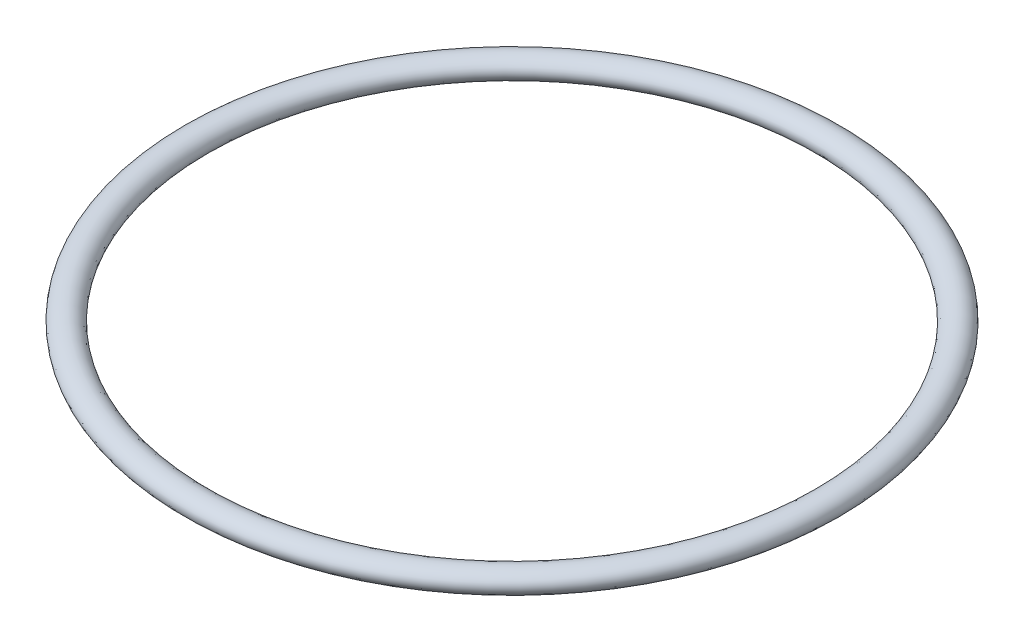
ISO-10303-21;
HEADER;
FILE_DESCRIPTION(('STEP AP214'),'2;1');
FILE_NAME('part.step','',(''),(''),'','','');
FILE_SCHEMA(('AUTOMOTIVE_DESIGN { 1 0 10303 214 1 1 1 1 }'));
ENDSEC;
DATA;
#1=APPLICATION_CONTEXT('core data for automotive mechanical design processes');
#2=APPLICATION_PROTOCOL_DEFINITION('international standard','automotive_design',2000,#1);
#3=PRODUCT_CONTEXT('',#1,'mechanical');
#4=PRODUCT('Part','Part','',(#3));
#5=PRODUCT_RELATED_PRODUCT_CATEGORY('part','',(#4));
#6=PRODUCT_DEFINITION_FORMATION('','',#4);
#7=PRODUCT_DEFINITION_CONTEXT('part definition',#1,'design');
#8=PRODUCT_DEFINITION('design','',#6,#7);
#9=PRODUCT_DEFINITION_SHAPE('','',#8);
#10=(LENGTH_UNIT() NAMED_UNIT(*) SI_UNIT(.MILLI.,.METRE.));
#11=(NAMED_UNIT(*) PLANE_ANGLE_UNIT() SI_UNIT($,.RADIAN.));
#12=(NAMED_UNIT(*) SI_UNIT($,.STERADIAN.) SOLID_ANGLE_UNIT());
#13=UNCERTAINTY_MEASURE_WITH_UNIT(LENGTH_MEASURE(1.E-05),#10,'distance_accuracy_value','');
#14=(GEOMETRIC_REPRESENTATION_CONTEXT(3) GLOBAL_UNCERTAINTY_ASSIGNED_CONTEXT((#13)) GLOBAL_UNIT_ASSIGNED_CONTEXT((#10,
#11,#12)) REPRESENTATION_CONTEXT('',''));
#15=CARTESIAN_POINT('',(0.,0.,0.));
#16=DIRECTION('',(0.,0.,1.));
#17=DIRECTION('',(1.,0.,0.));
#18=AXIS2_PLACEMENT_3D('',#15,#16,#17);
#19=CARTESIAN_POINT('',(22.,0.75,0.));
#20=DIRECTION('',(0.,0.,1.));
#21=DIRECTION('',(-1.,0.,0.));
#22=AXIS2_PLACEMENT_3D('',#19,#20,#21);
#23=ELLIPSE('',#22,1.,0.75);
#24=CARTESIAN_POINT('',(0.,0.,0.));
#25=DIRECTION('',(0.,-1.,0.));
#26=AXIS1_PLACEMENT('',#24,#25);
#27=SURFACE_OF_REVOLUTION('',#23,#26);
#28=ADVANCED_FACE('F30',(),#27,.F.);
#29=CLOSED_SHELL('',(#28));
#30=MANIFOLD_SOLID_BREP('B2',#29);
#31=ADVANCED_BREP_SHAPE_REPRESENTATION('',(#18,#30),#14);
#32=SHAPE_DEFINITION_REPRESENTATION(#9,#31);
ENDSEC;
END-ISO-10303-21;
